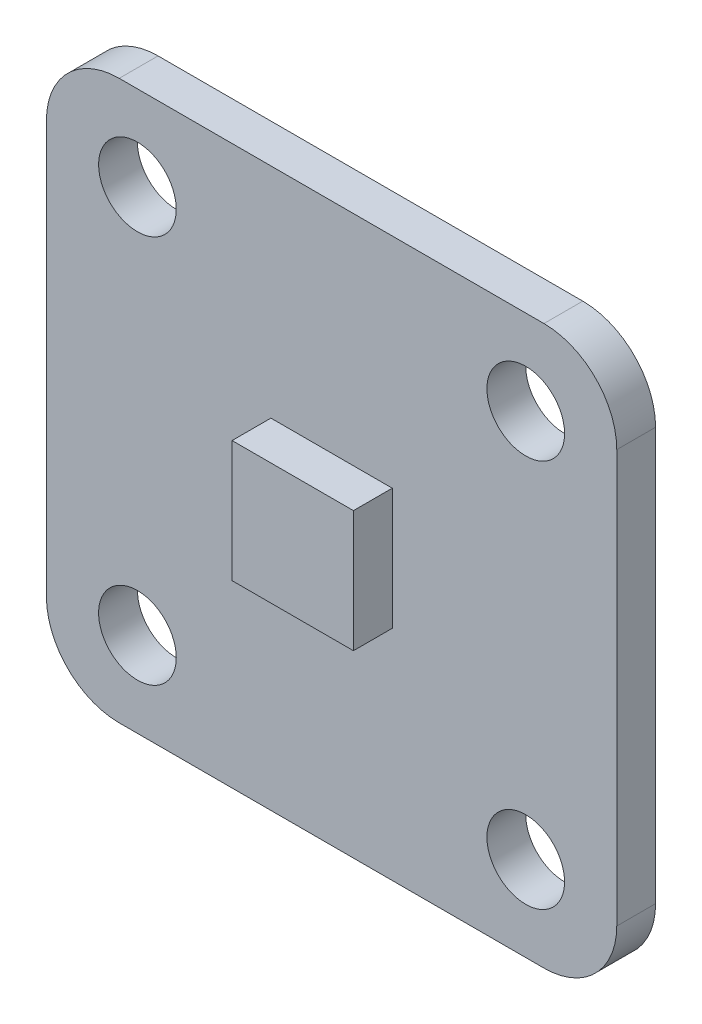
ISO-10303-21;
HEADER;
FILE_DESCRIPTION(('STEP AP214'),'2;1');
FILE_NAME('part.step','',(''),(''),'','','');
FILE_SCHEMA(('AUTOMOTIVE_DESIGN { 1 0 10303 214 1 1 1 1 }'));
ENDSEC;
DATA;
#1=APPLICATION_CONTEXT('core data for automotive mechanical design processes');
#2=APPLICATION_PROTOCOL_DEFINITION('international standard','automotive_design',2000,#1);
#3=PRODUCT_CONTEXT('',#1,'mechanical');
#4=PRODUCT('Part','Part','',(#3));
#5=PRODUCT_RELATED_PRODUCT_CATEGORY('part','',(#4));
#6=PRODUCT_DEFINITION_FORMATION('','',#4);
#7=PRODUCT_DEFINITION_CONTEXT('part definition',#1,'design');
#8=PRODUCT_DEFINITION('design','',#6,#7);
#9=PRODUCT_DEFINITION_SHAPE('','',#8);
#10=(LENGTH_UNIT() NAMED_UNIT(*) SI_UNIT(.MILLI.,.METRE.));
#11=(NAMED_UNIT(*) PLANE_ANGLE_UNIT() SI_UNIT($,.RADIAN.));
#12=(NAMED_UNIT(*) SI_UNIT($,.STERADIAN.) SOLID_ANGLE_UNIT());
#13=UNCERTAINTY_MEASURE_WITH_UNIT(LENGTH_MEASURE(1.E-05),#10,'distance_accuracy_value','');
#14=(GEOMETRIC_REPRESENTATION_CONTEXT(3) GLOBAL_UNCERTAINTY_ASSIGNED_CONTEXT((#13)) GLOBAL_UNIT_ASSIGNED_CONTEXT((#10,
#11,#12)) REPRESENTATION_CONTEXT('',''));
#15=CARTESIAN_POINT('',(0.,0.,0.));
#16=DIRECTION('',(0.,0.,1.));
#17=DIRECTION('',(1.,0.,0.));
#18=AXIS2_PLACEMENT_3D('',#15,#16,#17);
#19=CARTESIAN_POINT('',(0.,0.,1.6));
#20=DIRECTION('',(0.,0.,-1.));
#21=DIRECTION('',(-1.,0.,0.));
#22=AXIS2_PLACEMENT_3D('',#19,#20,#21);
#23=PLANE('',#22);
#24=CARTESIAN_POINT('',(-8.,8.,1.6));
#25=DIRECTION('',(0.,0.,1.));
#26=DIRECTION('',(-1.,0.,0.));
#27=AXIS2_PLACEMENT_3D('',#24,#25,#26);
#28=CIRCLE('',#27,1.6);
#29=CARTESIAN_POINT('',(-9.6,8.,1.6));
#30=VERTEX_POINT('',#29);
#31=EDGE_CURVE('E144',#30,#30,#28,.T.);
#32=ORIENTED_EDGE('',*,*,#31,.F.);
#33=EDGE_LOOP('',(#32));
#34=FACE_BOUND('',#33,.T.);
#35=CARTESIAN_POINT('',(8.,-8.,1.6));
#36=DIRECTION('',(0.,0.,1.));
#37=DIRECTION('',(-1.,0.,0.));
#38=AXIS2_PLACEMENT_3D('',#35,#36,#37);
#39=CIRCLE('',#38,1.6);
#40=CARTESIAN_POINT('',(6.4,-8.,1.6));
#41=VERTEX_POINT('',#40);
#42=EDGE_CURVE('E159',#41,#41,#39,.T.);
#43=ORIENTED_EDGE('',*,*,#42,.F.);
#44=EDGE_LOOP('',(#43));
#45=FACE_BOUND('',#44,.T.);
#46=DIRECTION('',(0.,-1.,0.));
#47=VECTOR('',#46,1.);
#48=CARTESIAN_POINT('',(-11.75,-11.5,1.6));
#49=LINE('',#48,#47);
#50=CARTESIAN_POINT('',(-11.75,8.5,1.6));
#51=VERTEX_POINT('',#50);
#52=CARTESIAN_POINT('',(-11.75,-8.5,1.6));
#53=VERTEX_POINT('',#52);
#54=EDGE_CURVE('E178',#51,#53,#49,.T.);
#55=ORIENTED_EDGE('',*,*,#54,.T.);
#56=CARTESIAN_POINT('',(-8.75,-8.5,1.6));
#57=DIRECTION('',(0.,0.,-1.));
#58=DIRECTION('',(-1.,0.,0.));
#59=AXIS2_PLACEMENT_3D('',#56,#57,#58);
#60=CIRCLE('',#59,3.);
#61=CARTESIAN_POINT('',(-8.75,-11.5,1.6));
#62=VERTEX_POINT('',#61);
#63=EDGE_CURVE('E218',#53,#62,#60,.F.);
#64=ORIENTED_EDGE('',*,*,#63,.T.);
#65=DIRECTION('',(1.,0.,0.));
#66=VECTOR('',#65,1.);
#67=CARTESIAN_POINT('',(-11.75,-11.5,1.6));
#68=LINE('',#67,#66);
#69=CARTESIAN_POINT('',(8.75000000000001,-11.5,1.6));
#70=VERTEX_POINT('',#69);
#71=EDGE_CURVE('E181',#62,#70,#68,.T.);
#72=ORIENTED_EDGE('',*,*,#71,.T.);
#73=CARTESIAN_POINT('',(8.75,-8.5,1.6));
#74=DIRECTION('',(0.,0.,-1.));
#75=DIRECTION('',(-1.,0.,0.));
#76=AXIS2_PLACEMENT_3D('',#73,#74,#75);
#77=CIRCLE('',#76,3.);
#78=CARTESIAN_POINT('',(11.75,-8.5,1.6));
#79=VERTEX_POINT('',#78);
#80=EDGE_CURVE('E216',#70,#79,#77,.F.);
#81=ORIENTED_EDGE('',*,*,#80,.T.);
#82=DIRECTION('',(0.,1.,0.));
#83=VECTOR('',#82,1.);
#84=CARTESIAN_POINT('',(11.75,-11.5,1.6));
#85=LINE('',#84,#83);
#86=CARTESIAN_POINT('',(11.75,8.5,1.6));
#87=VERTEX_POINT('',#86);
#88=EDGE_CURVE('E171',#79,#87,#85,.T.);
#89=ORIENTED_EDGE('',*,*,#88,.T.);
#90=CARTESIAN_POINT('',(8.75000000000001,8.5,1.6));
#91=DIRECTION('',(0.,0.,-1.));
#92=DIRECTION('',(-1.,0.,0.));
#93=AXIS2_PLACEMENT_3D('',#90,#91,#92);
#94=CIRCLE('',#93,3.);
#95=CARTESIAN_POINT('',(8.75000000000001,11.5,1.6));
#96=VERTEX_POINT('',#95);
#97=EDGE_CURVE('E212',#87,#96,#94,.F.);
#98=ORIENTED_EDGE('',*,*,#97,.T.);
#99=DIRECTION('',(-1.,0.,0.));
#100=VECTOR('',#99,1.);
#101=CARTESIAN_POINT('',(-11.75,11.5,1.6));
#102=LINE('',#101,#100);
#103=CARTESIAN_POINT('',(-8.75,11.5,1.6));
#104=VERTEX_POINT('',#103);
#105=EDGE_CURVE('E174',#96,#104,#102,.T.);
#106=ORIENTED_EDGE('',*,*,#105,.T.);
#107=CARTESIAN_POINT('',(-8.75,8.5,1.6));
#108=DIRECTION('',(0.,0.,-1.));
#109=DIRECTION('',(-1.,0.,0.));
#110=AXIS2_PLACEMENT_3D('',#107,#108,#109);
#111=CIRCLE('',#110,3.);
#112=EDGE_CURVE('E214',#104,#51,#111,.F.);
#113=ORIENTED_EDGE('',*,*,#112,.T.);
#114=EDGE_LOOP('',(#55,#64,#72,#81,#89,#98,#106,#113));
#115=FACE_BOUND('',#114,.T.);
#116=CARTESIAN_POINT('',(8.,8.,1.6));
#117=DIRECTION('',(0.,0.,1.));
#118=DIRECTION('',(1.,0.,0.));
#119=AXIS2_PLACEMENT_3D('',#116,#117,#118);
#120=CIRCLE('',#119,1.6);
#121=CARTESIAN_POINT('',(9.6,8.,1.6));
#122=VERTEX_POINT('',#121);
#123=EDGE_CURVE('E165',#122,#122,#120,.T.);
#124=ORIENTED_EDGE('',*,*,#123,.F.);
#125=EDGE_LOOP('',(#124));
#126=FACE_BOUND('',#125,.T.);
#127=CARTESIAN_POINT('',(-8.,-8.,1.6));
#128=DIRECTION('',(0.,0.,1.));
#129=DIRECTION('',(1.,0.,0.));
#130=AXIS2_PLACEMENT_3D('',#127,#128,#129);
#131=CIRCLE('',#130,1.6);
#132=CARTESIAN_POINT('',(-6.4,-8.,1.6));
#133=VERTEX_POINT('',#132);
#134=EDGE_CURVE('E153',#133,#133,#131,.T.);
#135=ORIENTED_EDGE('',*,*,#134,.F.);
#136=EDGE_LOOP('',(#135));
#137=FACE_BOUND('',#136,.T.);
#138=DIRECTION('',(0.,1.,0.));
#139=VECTOR('',#138,1.);
#140=CARTESIAN_POINT('',(2.5,-2.5,1.6));
#141=LINE('',#140,#139);
#142=CARTESIAN_POINT('',(2.5,-2.5,1.6));
#143=VERTEX_POINT('',#142);
#144=CARTESIAN_POINT('',(2.5,2.5,1.6));
#145=VERTEX_POINT('',#144);
#146=EDGE_CURVE('E140',#143,#145,#141,.T.);
#147=ORIENTED_EDGE('',*,*,#146,.F.);
#148=DIRECTION('',(1.,0.,0.));
#149=VECTOR('',#148,1.);
#150=CARTESIAN_POINT('',(-2.5,-2.5,1.6));
#151=LINE('',#150,#149);
#152=CARTESIAN_POINT('',(-2.5,-2.5,1.6));
#153=VERTEX_POINT('',#152);
#154=EDGE_CURVE('E137',#153,#143,#151,.T.);
#155=ORIENTED_EDGE('',*,*,#154,.F.);
#156=DIRECTION('',(0.,-1.,0.));
#157=VECTOR('',#156,1.);
#158=CARTESIAN_POINT('',(-2.5,-2.5,1.6));
#159=LINE('',#158,#157);
#160=CARTESIAN_POINT('',(-2.5,2.5,1.6));
#161=VERTEX_POINT('',#160);
#162=EDGE_CURVE('E52',#161,#153,#159,.T.);
#163=ORIENTED_EDGE('',*,*,#162,.F.);
#164=DIRECTION('',(-1.,0.,0.));
#165=VECTOR('',#164,1.);
#166=CARTESIAN_POINT('',(-2.5,2.5,1.6));
#167=LINE('',#166,#165);
#168=EDGE_CURVE('E47',#145,#161,#167,.T.);
#169=ORIENTED_EDGE('',*,*,#168,.F.);
#170=EDGE_LOOP('',(#147,#155,#163,#169));
#171=FACE_BOUND('',#170,.T.);
#172=ADVANCED_FACE('F32',(#34,#45,#115,#126,#137,#171),#23,.F.);
#173=CARTESIAN_POINT('',(0.,0.,0.));
#174=DIRECTION('',(0.,0.,-1.));
#175=DIRECTION('',(-1.,0.,0.));
#176=AXIS2_PLACEMENT_3D('',#173,#174,#175);
#177=PLANE('',#176);
#178=CARTESIAN_POINT('',(-8.,-8.,0.));
#179=DIRECTION('',(0.,0.,1.));
#180=DIRECTION('',(1.,0.,0.));
#181=AXIS2_PLACEMENT_3D('',#178,#179,#180);
#182=CIRCLE('',#181,1.6);
#183=CARTESIAN_POINT('',(-6.4,-8.,0.));
#184=VERTEX_POINT('',#183);
#185=EDGE_CURVE('E151',#184,#184,#182,.T.);
#186=ORIENTED_EDGE('',*,*,#185,.T.);
#187=EDGE_LOOP('',(#186));
#188=FACE_BOUND('',#187,.T.);
#189=CARTESIAN_POINT('',(8.,8.,0.));
#190=DIRECTION('',(0.,0.,1.));
#191=DIRECTION('',(1.,0.,0.));
#192=AXIS2_PLACEMENT_3D('',#189,#190,#191);
#193=CIRCLE('',#192,1.6);
#194=CARTESIAN_POINT('',(9.6,8.,0.));
#195=VERTEX_POINT('',#194);
#196=EDGE_CURVE('E162',#195,#195,#193,.T.);
#197=ORIENTED_EDGE('',*,*,#196,.T.);
#198=EDGE_LOOP('',(#197));
#199=FACE_BOUND('',#198,.T.);
#200=DIRECTION('',(1.,0.,0.));
#201=VECTOR('',#200,1.);
#202=CARTESIAN_POINT('',(-11.75,-11.5,0.));
#203=LINE('',#202,#201);
#204=CARTESIAN_POINT('',(-8.75,-11.5,0.));
#205=VERTEX_POINT('',#204);
#206=CARTESIAN_POINT('',(8.75000000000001,-11.5,0.));
#207=VERTEX_POINT('',#206);
#208=EDGE_CURVE('E175',#205,#207,#203,.T.);
#209=ORIENTED_EDGE('',*,*,#208,.F.);
#210=CARTESIAN_POINT('',(-8.75,-8.5,0.));
#211=DIRECTION('',(0.,0.,-1.));
#212=DIRECTION('',(-1.,0.,0.));
#213=AXIS2_PLACEMENT_3D('',#210,#211,#212);
#214=CIRCLE('',#213,3.);
#215=CARTESIAN_POINT('',(-11.75,-8.5,0.));
#216=VERTEX_POINT('',#215);
#217=EDGE_CURVE('E205',#205,#216,#214,.T.);
#218=ORIENTED_EDGE('',*,*,#217,.T.);
#219=DIRECTION('',(0.,-1.,0.));
#220=VECTOR('',#219,1.);
#221=CARTESIAN_POINT('',(-11.75,-11.5,0.));
#222=LINE('',#221,#220);
#223=CARTESIAN_POINT('',(-11.75,8.5,0.));
#224=VERTEX_POINT('',#223);
#225=EDGE_CURVE('E190',#224,#216,#222,.T.);
#226=ORIENTED_EDGE('',*,*,#225,.F.);
#227=CARTESIAN_POINT('',(-8.75,8.5,0.));
#228=DIRECTION('',(0.,0.,-1.));
#229=DIRECTION('',(-1.,0.,0.));
#230=AXIS2_PLACEMENT_3D('',#227,#228,#229);
#231=CIRCLE('',#230,3.);
#232=CARTESIAN_POINT('',(-8.75,11.5,0.));
#233=VERTEX_POINT('',#232);
#234=EDGE_CURVE('E201',#224,#233,#231,.T.);
#235=ORIENTED_EDGE('',*,*,#234,.T.);
#236=DIRECTION('',(-1.,0.,0.));
#237=VECTOR('',#236,1.);
#238=CARTESIAN_POINT('',(-11.75,11.5,0.));
#239=LINE('',#238,#237);
#240=CARTESIAN_POINT('',(8.75000000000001,11.5,0.));
#241=VERTEX_POINT('',#240);
#242=EDGE_CURVE('E187',#241,#233,#239,.T.);
#243=ORIENTED_EDGE('',*,*,#242,.F.);
#244=CARTESIAN_POINT('',(8.75000000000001,8.5,0.));
#245=DIRECTION('',(0.,0.,-1.));
#246=DIRECTION('',(-1.,0.,0.));
#247=AXIS2_PLACEMENT_3D('',#244,#245,#246);
#248=CIRCLE('',#247,3.);
#249=CARTESIAN_POINT('',(11.75,8.5,0.));
#250=VERTEX_POINT('',#249);
#251=EDGE_CURVE('E199',#241,#250,#248,.T.);
#252=ORIENTED_EDGE('',*,*,#251,.T.);
#253=DIRECTION('',(0.,1.,0.));
#254=VECTOR('',#253,1.);
#255=CARTESIAN_POINT('',(11.75,-11.5,0.));
#256=LINE('',#255,#254);
#257=CARTESIAN_POINT('',(11.75,-8.5,0.));
#258=VERTEX_POINT('',#257);
#259=EDGE_CURVE('E168',#258,#250,#256,.T.);
#260=ORIENTED_EDGE('',*,*,#259,.F.);
#261=CARTESIAN_POINT('',(8.75,-8.5,0.));
#262=DIRECTION('',(0.,0.,-1.));
#263=DIRECTION('',(-1.,0.,0.));
#264=AXIS2_PLACEMENT_3D('',#261,#262,#263);
#265=CIRCLE('',#264,3.);
#266=EDGE_CURVE('E203',#258,#207,#265,.T.);
#267=ORIENTED_EDGE('',*,*,#266,.T.);
#268=EDGE_LOOP('',(#209,#218,#226,#235,#243,#252,#260,#267));
#269=FACE_BOUND('',#268,.T.);
#270=CARTESIAN_POINT('',(8.,-8.,0.));
#271=DIRECTION('',(0.,0.,1.));
#272=DIRECTION('',(-1.,0.,0.));
#273=AXIS2_PLACEMENT_3D('',#270,#271,#272);
#274=CIRCLE('',#273,1.6);
#275=CARTESIAN_POINT('',(6.4,-8.,0.));
#276=VERTEX_POINT('',#275);
#277=EDGE_CURVE('E156',#276,#276,#274,.T.);
#278=ORIENTED_EDGE('',*,*,#277,.T.);
#279=EDGE_LOOP('',(#278));
#280=FACE_BOUND('',#279,.T.);
#281=CARTESIAN_POINT('',(-8.,8.,0.));
#282=DIRECTION('',(0.,0.,1.));
#283=DIRECTION('',(-1.,0.,0.));
#284=AXIS2_PLACEMENT_3D('',#281,#282,#283);
#285=CIRCLE('',#284,1.6);
#286=CARTESIAN_POINT('',(-9.6,8.,0.));
#287=VERTEX_POINT('',#286);
#288=EDGE_CURVE('E141',#287,#287,#285,.T.);
#289=ORIENTED_EDGE('',*,*,#288,.T.);
#290=EDGE_LOOP('',(#289));
#291=FACE_BOUND('',#290,.T.);
#292=ADVANCED_FACE('F235',(#188,#199,#269,#280,#291),#177,.T.);
#293=CARTESIAN_POINT('',(11.75,-11.5,1.6));
#294=DIRECTION('',(-1.,0.,0.));
#295=DIRECTION('',(0.,0.,1.));
#296=AXIS2_PLACEMENT_3D('',#293,#294,#295);
#297=PLANE('',#296);
#298=ORIENTED_EDGE('',*,*,#88,.F.);
#299=DIRECTION('',(0.,0.,-1.));
#300=VECTOR('',#299,1.);
#301=CARTESIAN_POINT('',(11.75,-8.5,1.6));
#302=LINE('',#301,#300);
#303=EDGE_CURVE('E222',#79,#258,#302,.T.);
#304=ORIENTED_EDGE('',*,*,#303,.T.);
#305=ORIENTED_EDGE('',*,*,#259,.T.);
#306=DIRECTION('',(0.,0.,-1.));
#307=VECTOR('',#306,1.);
#308=CARTESIAN_POINT('',(11.75,8.5,1.6));
#309=LINE('',#308,#307);
#310=EDGE_CURVE('E220',#250,#87,#309,.F.);
#311=ORIENTED_EDGE('',*,*,#310,.T.);
#312=EDGE_LOOP('',(#298,#304,#305,#311));
#313=FACE_BOUND('',#312,.T.);
#314=ADVANCED_FACE('F263',(#313),#297,.F.);
#315=CARTESIAN_POINT('',(-11.75,11.5,1.6));
#316=DIRECTION('',(0.,-1.,0.));
#317=DIRECTION('',(0.,0.,-1.));
#318=AXIS2_PLACEMENT_3D('',#315,#316,#317);
#319=PLANE('',#318);
#320=ORIENTED_EDGE('',*,*,#242,.T.);
#321=DIRECTION('',(0.,0.,-1.));
#322=VECTOR('',#321,1.);
#323=CARTESIAN_POINT('',(-8.75,11.5,1.6));
#324=LINE('',#323,#322);
#325=EDGE_CURVE('E11',#233,#104,#324,.F.);
#326=ORIENTED_EDGE('',*,*,#325,.T.);
#327=ORIENTED_EDGE('',*,*,#105,.F.);
#328=DIRECTION('',(0.,0.,-1.));
#329=VECTOR('',#328,1.);
#330=CARTESIAN_POINT('',(8.75000000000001,11.5,1.6));
#331=LINE('',#330,#329);
#332=EDGE_CURVE('E40',#96,#241,#331,.T.);
#333=ORIENTED_EDGE('',*,*,#332,.T.);
#334=EDGE_LOOP('',(#320,#326,#327,#333));
#335=FACE_BOUND('',#334,.T.);
#336=ADVANCED_FACE('F229',(#335),#319,.F.);
#337=CARTESIAN_POINT('',(-11.75,-11.5,1.6));
#338=DIRECTION('',(1.,0.,0.));
#339=DIRECTION('',(0.,0.,-1.));
#340=AXIS2_PLACEMENT_3D('',#337,#338,#339);
#341=PLANE('',#340);
#342=ORIENTED_EDGE('',*,*,#225,.T.);
#343=DIRECTION('',(0.,0.,-1.));
#344=VECTOR('',#343,1.);
#345=CARTESIAN_POINT('',(-11.75,-8.5,1.6));
#346=LINE('',#345,#344);
#347=EDGE_CURVE('E210',#216,#53,#346,.F.);
#348=ORIENTED_EDGE('',*,*,#347,.T.);
#349=ORIENTED_EDGE('',*,*,#54,.F.);
#350=DIRECTION('',(0.,0.,-1.));
#351=VECTOR('',#350,1.);
#352=CARTESIAN_POINT('',(-11.75,8.5,1.6));
#353=LINE('',#352,#351);
#354=EDGE_CURVE('E207',#51,#224,#353,.T.);
#355=ORIENTED_EDGE('',*,*,#354,.T.);
#356=EDGE_LOOP('',(#342,#348,#349,#355));
#357=FACE_BOUND('',#356,.T.);
#358=ADVANCED_FACE('F245',(#357),#341,.F.);
#359=CARTESIAN_POINT('',(-11.75,-11.5,1.6));
#360=DIRECTION('',(0.,1.,0.));
#361=DIRECTION('',(0.,0.,1.));
#362=AXIS2_PLACEMENT_3D('',#359,#360,#361);
#363=PLANE('',#362);
#364=ORIENTED_EDGE('',*,*,#71,.F.);
#365=DIRECTION('',(0.,0.,-1.));
#366=VECTOR('',#365,1.);
#367=CARTESIAN_POINT('',(-8.75,-11.5,1.6));
#368=LINE('',#367,#366);
#369=EDGE_CURVE('E196',#62,#205,#368,.T.);
#370=ORIENTED_EDGE('',*,*,#369,.T.);
#371=ORIENTED_EDGE('',*,*,#208,.T.);
#372=DIRECTION('',(0.,0.,-1.));
#373=VECTOR('',#372,1.);
#374=CARTESIAN_POINT('',(8.75000000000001,-11.5,1.6));
#375=LINE('',#374,#373);
#376=EDGE_CURVE('E184',#207,#70,#375,.F.);
#377=ORIENTED_EDGE('',*,*,#376,.T.);
#378=EDGE_LOOP('',(#364,#370,#371,#377));
#379=FACE_BOUND('',#378,.T.);
#380=ADVANCED_FACE('F255',(#379),#363,.F.);
#381=CARTESIAN_POINT('',(8.,8.,1.6));
#382=DIRECTION('',(0.,0.,-1.));
#383=DIRECTION('',(-1.,0.,0.));
#384=AXIS2_PLACEMENT_3D('',#381,#382,#383);
#385=CYLINDRICAL_SURFACE('',#384,1.6);
#386=ORIENTED_EDGE('',*,*,#123,.T.);
#387=EDGE_LOOP('',(#386));
#388=FACE_BOUND('',#387,.T.);
#389=ORIENTED_EDGE('',*,*,#196,.F.);
#390=EDGE_LOOP('',(#389));
#391=FACE_BOUND('',#390,.T.);
#392=ADVANCED_FACE('F282',(#388,#391),#385,.F.);
#393=CARTESIAN_POINT('',(8.,-8.,1.6));
#394=DIRECTION('',(0.,0.,-1.));
#395=DIRECTION('',(-1.,0.,0.));
#396=AXIS2_PLACEMENT_3D('',#393,#394,#395);
#397=CYLINDRICAL_SURFACE('',#396,1.6);
#398=ORIENTED_EDGE('',*,*,#42,.T.);
#399=EDGE_LOOP('',(#398));
#400=FACE_BOUND('',#399,.T.);
#401=ORIENTED_EDGE('',*,*,#277,.F.);
#402=EDGE_LOOP('',(#401));
#403=FACE_BOUND('',#402,.T.);
#404=ADVANCED_FACE('F365',(#400,#403),#397,.F.);
#405=CARTESIAN_POINT('',(-8.,-8.,1.6));
#406=DIRECTION('',(0.,0.,-1.));
#407=DIRECTION('',(-1.,0.,0.));
#408=AXIS2_PLACEMENT_3D('',#405,#406,#407);
#409=CYLINDRICAL_SURFACE('',#408,1.6);
#410=ORIENTED_EDGE('',*,*,#134,.T.);
#411=EDGE_LOOP('',(#410));
#412=FACE_BOUND('',#411,.T.);
#413=ORIENTED_EDGE('',*,*,#185,.F.);
#414=EDGE_LOOP('',(#413));
#415=FACE_BOUND('',#414,.T.);
#416=ADVANCED_FACE('F362',(#412,#415),#409,.F.);
#417=CARTESIAN_POINT('',(-8.,8.,1.6));
#418=DIRECTION('',(0.,0.,-1.));
#419=DIRECTION('',(-1.,0.,0.));
#420=AXIS2_PLACEMENT_3D('',#417,#418,#419);
#421=CYLINDRICAL_SURFACE('',#420,1.6);
#422=ORIENTED_EDGE('',*,*,#31,.T.);
#423=EDGE_LOOP('',(#422));
#424=FACE_BOUND('',#423,.T.);
#425=ORIENTED_EDGE('',*,*,#288,.F.);
#426=EDGE_LOOP('',(#425));
#427=FACE_BOUND('',#426,.T.);
#428=ADVANCED_FACE('F295',(#424,#427),#421,.F.);
#429=CARTESIAN_POINT('',(-8.75,-8.5,1.6));
#430=DIRECTION('',(0.,0.,-1.));
#431=DIRECTION('',(-1.,0.,0.));
#432=AXIS2_PLACEMENT_3D('',#429,#430,#431);
#433=CYLINDRICAL_SURFACE('',#432,3.);
#434=ORIENTED_EDGE('',*,*,#63,.F.);
#435=ORIENTED_EDGE('',*,*,#347,.F.);
#436=ORIENTED_EDGE('',*,*,#217,.F.);
#437=ORIENTED_EDGE('',*,*,#369,.F.);
#438=EDGE_LOOP('',(#434,#435,#436,#437));
#439=FACE_BOUND('',#438,.T.);
#440=ADVANCED_FACE('F253',(#439),#433,.T.);
#441=CARTESIAN_POINT('',(8.75,-8.5,1.6));
#442=DIRECTION('',(0.,0.,-1.));
#443=DIRECTION('',(-1.,0.,0.));
#444=AXIS2_PLACEMENT_3D('',#441,#442,#443);
#445=CYLINDRICAL_SURFACE('',#444,3.);
#446=ORIENTED_EDGE('',*,*,#80,.F.);
#447=ORIENTED_EDGE('',*,*,#376,.F.);
#448=ORIENTED_EDGE('',*,*,#266,.F.);
#449=ORIENTED_EDGE('',*,*,#303,.F.);
#450=EDGE_LOOP('',(#446,#447,#448,#449));
#451=FACE_BOUND('',#450,.T.);
#452=ADVANCED_FACE('F260',(#451),#445,.T.);
#453=CARTESIAN_POINT('',(-8.75,8.5,1.6));
#454=DIRECTION('',(0.,0.,-1.));
#455=DIRECTION('',(-1.,0.,0.));
#456=AXIS2_PLACEMENT_3D('',#453,#454,#455);
#457=CYLINDRICAL_SURFACE('',#456,3.);
#458=ORIENTED_EDGE('',*,*,#112,.F.);
#459=ORIENTED_EDGE('',*,*,#325,.F.);
#460=ORIENTED_EDGE('',*,*,#234,.F.);
#461=ORIENTED_EDGE('',*,*,#354,.F.);
#462=EDGE_LOOP('',(#458,#459,#460,#461));
#463=FACE_BOUND('',#462,.T.);
#464=ADVANCED_FACE('F242',(#463),#457,.T.);
#465=CARTESIAN_POINT('',(8.75000000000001,8.5,1.6));
#466=DIRECTION('',(0.,0.,-1.));
#467=DIRECTION('',(-1.,0.,0.));
#468=AXIS2_PLACEMENT_3D('',#465,#466,#467);
#469=CYLINDRICAL_SURFACE('',#468,3.);
#470=ORIENTED_EDGE('',*,*,#97,.F.);
#471=ORIENTED_EDGE('',*,*,#310,.F.);
#472=ORIENTED_EDGE('',*,*,#251,.F.);
#473=ORIENTED_EDGE('',*,*,#332,.F.);
#474=EDGE_LOOP('',(#470,#471,#472,#473));
#475=FACE_BOUND('',#474,.T.);
#476=ADVANCED_FACE('F34',(#475),#469,.T.);
#477=CARTESIAN_POINT('',(2.5,-2.5,3.2));
#478=DIRECTION('',(-1.,0.,0.));
#479=DIRECTION('',(0.,0.,1.));
#480=AXIS2_PLACEMENT_3D('',#477,#478,#479);
#481=PLANE('',#480);
#482=ORIENTED_EDGE('',*,*,#146,.T.);
#483=DIRECTION('',(0.,0.,-1.));
#484=VECTOR('',#483,1.);
#485=CARTESIAN_POINT('',(2.5,2.5,3.2));
#486=LINE('',#485,#484);
#487=CARTESIAN_POINT('',(2.5,2.5,3.2));
#488=VERTEX_POINT('',#487);
#489=EDGE_CURVE('E121',#488,#145,#486,.T.);
#490=ORIENTED_EDGE('',*,*,#489,.F.);
#491=DIRECTION('',(0.,1.,0.));
#492=VECTOR('',#491,1.);
#493=CARTESIAN_POINT('',(2.5,-2.5,3.2));
#494=LINE('',#493,#492);
#495=CARTESIAN_POINT('',(2.5,-2.5,3.2));
#496=VERTEX_POINT('',#495);
#497=EDGE_CURVE('E128',#496,#488,#494,.T.);
#498=ORIENTED_EDGE('',*,*,#497,.F.);
#499=DIRECTION('',(0.,0.,-1.));
#500=VECTOR('',#499,1.);
#501=CARTESIAN_POINT('',(2.5,-2.5,3.2));
#502=LINE('',#501,#500);
#503=EDGE_CURVE('E390',#496,#143,#502,.T.);
#504=ORIENTED_EDGE('',*,*,#503,.T.);
#505=EDGE_LOOP('',(#482,#490,#498,#504));
#506=FACE_BOUND('',#505,.T.);
#507=ADVANCED_FACE('F139',(#506),#481,.F.);
#508=CARTESIAN_POINT('',(-2.5,2.5,3.2));
#509=DIRECTION('',(0.,-1.,0.));
#510=DIRECTION('',(0.,0.,-1.));
#511=AXIS2_PLACEMENT_3D('',#508,#509,#510);
#512=PLANE('',#511);
#513=ORIENTED_EDGE('',*,*,#168,.T.);
#514=DIRECTION('',(0.,0.,-1.));
#515=VECTOR('',#514,1.);
#516=CARTESIAN_POINT('',(-2.5,2.5,3.2));
#517=LINE('',#516,#515);
#518=CARTESIAN_POINT('',(-2.5,2.5,3.2));
#519=VERTEX_POINT('',#518);
#520=EDGE_CURVE('E124',#519,#161,#517,.T.);
#521=ORIENTED_EDGE('',*,*,#520,.F.);
#522=DIRECTION('',(-1.,0.,0.));
#523=VECTOR('',#522,1.);
#524=CARTESIAN_POINT('',(-2.5,2.5,3.2));
#525=LINE('',#524,#523);
#526=EDGE_CURVE('E117',#488,#519,#525,.T.);
#527=ORIENTED_EDGE('',*,*,#526,.F.);
#528=ORIENTED_EDGE('',*,*,#489,.T.);
#529=EDGE_LOOP('',(#513,#521,#527,#528));
#530=FACE_BOUND('',#529,.T.);
#531=ADVANCED_FACE('F119',(#530),#512,.F.);
#532=CARTESIAN_POINT('',(-2.5,-2.5,3.2));
#533=DIRECTION('',(1.,0.,0.));
#534=DIRECTION('',(0.,0.,-1.));
#535=AXIS2_PLACEMENT_3D('',#532,#533,#534);
#536=PLANE('',#535);
#537=ORIENTED_EDGE('',*,*,#162,.T.);
#538=DIRECTION('',(0.,0.,-1.));
#539=VECTOR('',#538,1.);
#540=CARTESIAN_POINT('',(-2.5,-2.5,3.2));
#541=LINE('',#540,#539);
#542=CARTESIAN_POINT('',(-2.5,-2.5,3.2));
#543=VERTEX_POINT('',#542);
#544=EDGE_CURVE('E146',#543,#153,#541,.T.);
#545=ORIENTED_EDGE('',*,*,#544,.F.);
#546=DIRECTION('',(0.,-1.,0.));
#547=VECTOR('',#546,1.);
#548=CARTESIAN_POINT('',(-2.5,-2.5,3.2));
#549=LINE('',#548,#547);
#550=EDGE_CURVE('E127',#519,#543,#549,.T.);
#551=ORIENTED_EDGE('',*,*,#550,.F.);
#552=ORIENTED_EDGE('',*,*,#520,.T.);
#553=EDGE_LOOP('',(#537,#545,#551,#552));
#554=FACE_BOUND('',#553,.T.);
#555=ADVANCED_FACE('F329',(#554),#536,.F.);
#556=CARTESIAN_POINT('',(-2.5,-2.5,3.2));
#557=DIRECTION('',(0.,1.,0.));
#558=DIRECTION('',(0.,0.,1.));
#559=AXIS2_PLACEMENT_3D('',#556,#557,#558);
#560=PLANE('',#559);
#561=ORIENTED_EDGE('',*,*,#154,.T.);
#562=ORIENTED_EDGE('',*,*,#503,.F.);
#563=DIRECTION('',(1.,0.,0.));
#564=VECTOR('',#563,1.);
#565=CARTESIAN_POINT('',(-2.5,-2.5,3.2));
#566=LINE('',#565,#564);
#567=EDGE_CURVE('E133',#543,#496,#566,.T.);
#568=ORIENTED_EDGE('',*,*,#567,.F.);
#569=ORIENTED_EDGE('',*,*,#544,.T.);
#570=EDGE_LOOP('',(#561,#562,#568,#569));
#571=FACE_BOUND('',#570,.T.);
#572=ADVANCED_FACE('F338',(#571),#560,.F.);
#573=CARTESIAN_POINT('',(0.,0.,3.2));
#574=DIRECTION('',(0.,0.,-1.));
#575=DIRECTION('',(-1.,0.,0.));
#576=AXIS2_PLACEMENT_3D('',#573,#574,#575);
#577=PLANE('',#576);
#578=ORIENTED_EDGE('',*,*,#497,.T.);
#579=ORIENTED_EDGE('',*,*,#526,.T.);
#580=ORIENTED_EDGE('',*,*,#550,.T.);
#581=ORIENTED_EDGE('',*,*,#567,.T.);
#582=EDGE_LOOP('',(#578,#579,#580,#581));
#583=FACE_BOUND('',#582,.T.);
#584=ADVANCED_FACE('F131',(#583),#577,.F.);
#585=CLOSED_SHELL('',(#172,#292,#314,#336,#358,#380,#392,#404,#416,#428,#440,#452,#464,#476,
#507,#531,#555,#572,#584));
#586=MANIFOLD_SOLID_BREP('B2',#585);
#587=ADVANCED_BREP_SHAPE_REPRESENTATION('',(#18,#586),#14);
#588=SHAPE_DEFINITION_REPRESENTATION(#9,#587);
ENDSEC;
END-ISO-10303-21;
